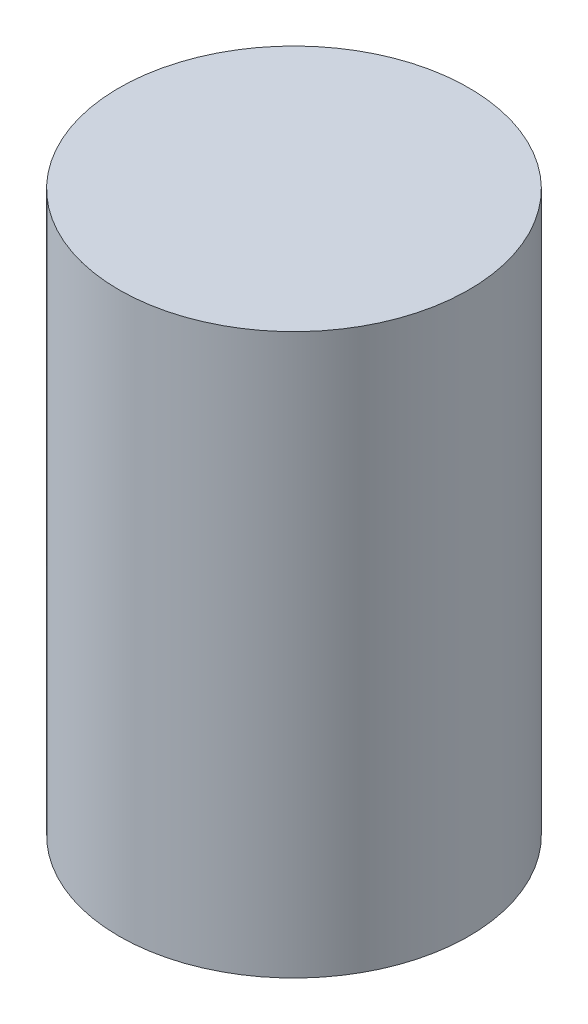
from build123d import *


with BuildPart() as part:
    # Esquisse1 → R_volution1 (revolve)
    with BuildSketch(Plane.XY, mode=Mode.PRIVATE) as r_volution1_sk:
        with BuildLine():
            Line((-12.500070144, 37.5), (0, 37.5))
            Line((0, 37.5), (0, 7.5))
            ThreePointArc((0, 7.5), (-4.103206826, 6.278032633), (-6.869351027, 3.010318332))
            Line((-6.869351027, 3.010318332), (-9.284107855, -2.5))
            Line((-9.284107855, -2.5), (-12.500070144, -2.5))
            Line((-12.500070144, -2.5), (-12.500070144, 37.5))
        make_face()
    revolve(r_volution1_sk.sketch.rotate(Axis((0, 37.5, 0), (0, -1, 0)), 270), axis=Axis((0, 37.5, 0), (0, -1, 0)))


solid = part.part
